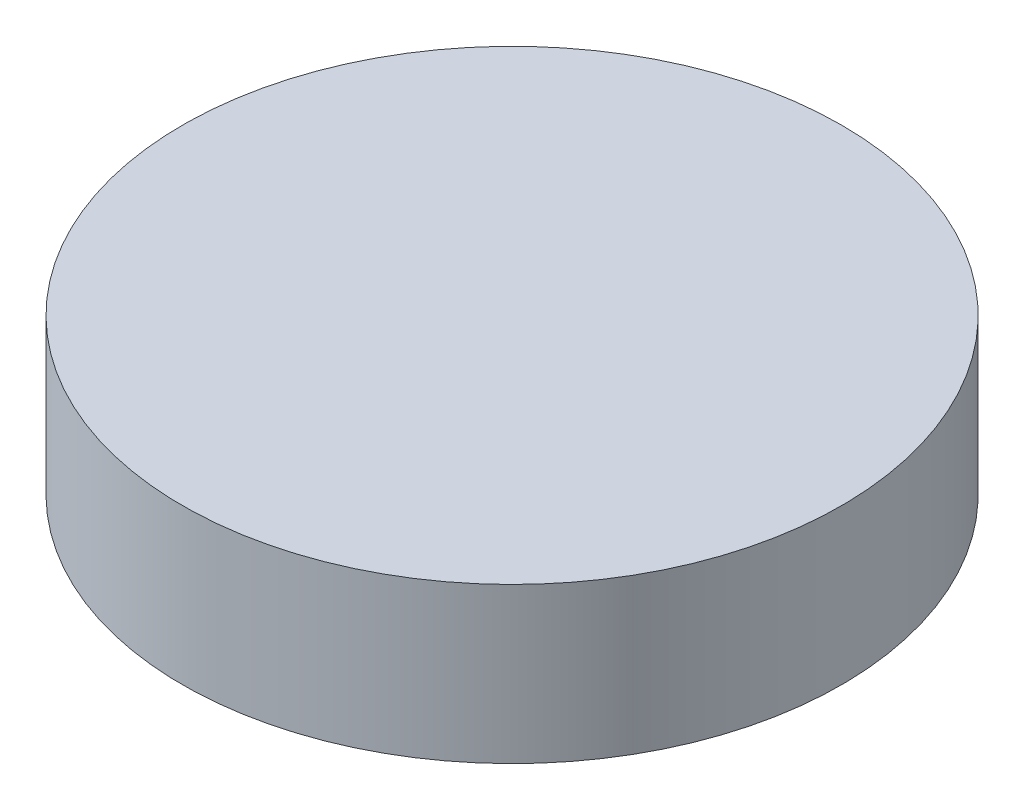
from build123d import *


with BuildPart() as part:
    # Sketch 1 → Revolve 1 (revolve)
    with BuildSketch(Plane.XY, mode=Mode.PRIVATE) as revolve_1_sk:
        Polygon((0, 378), (-565, 378), (-565, 112), (-360, 0), (0, 0), align=None)
    revolve(revolve_1_sk.sketch.rotate(Axis((0, 0, 0), (0, 1, 0)), 270), axis=Axis((0, 0, 0), (0, 1, 0)))


solid = part.part
